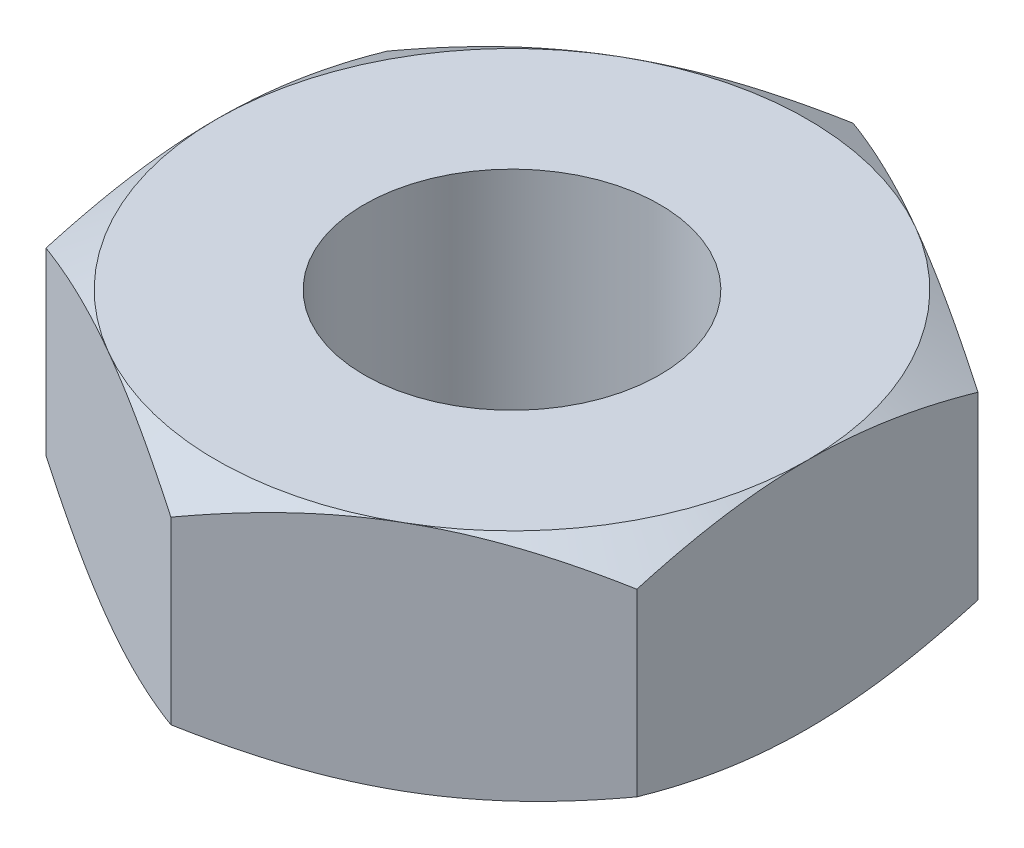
from build123d import *

# Parameters (mm, degrees)
BOSS_EXTRUDE1_DEPTH     = 5
SKETCH2_R               = 6.35
CUT_EXTRUDE1_DEPTH      = 22.82529114
SKETCH3_OUTSIDE_W       = 114.482
SKETCH3_OUTSIDE_H       = 118.412
SKETCH3_OUTSIDE_R       = 12.7
CUT_EXTRUDE2_DEPTH      = 22.82529114
CUT_EXTRUDE2_DRAFT      = -60
MIRROR1_COPY_1_SKETCH_W = 114.482
MIRROR1_COPY_1_SKETCH_H = 118.412
MIRROR1_COPY_1_SKETCH_R = 12.7
MIRROR1_COPY_1_DEPTH    = 22.82529114
MIRROR1_COPY_1_DRAFT    = -60


with BuildPart() as part:
    # Sketch1 → Boss-Extrude1 (new, symmetric)
    with BuildSketch(Plane(origin=(0, 0, 0), x_dir=(1, 0, 0), z_dir=(0, 1, 0))):
        Polygon((12.7, 7.332348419), (0, 14.664696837), (-12.7, 7.332348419), (-12.7, -7.332348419), (0, -14.664696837), (12.7, -7.332348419), align=None)
    extrude(amount=BOSS_EXTRUDE1_DEPTH, both=True)

    # Sketch2 → Cut-Extrude1 (cut, through all)
    with BuildSketch(Plane(origin=(0, 5, 0), x_dir=(1, 0, 0), z_dir=(0, 1, 0))):
        with Locations(Location((0, 0, 0), (0, 0, 270))):
            Circle(SKETCH2_R)
    extrude(amount=-CUT_EXTRUDE1_DEPTH, mode=Mode.SUBTRACT)


with BuildPart() as cut_extrude2_tool:
    # Sketch3 outside → Cut-Extrude2 (with draft: the straight prism first)
    with BuildSketch(Plane(origin=(0, 5, 0), x_dir=(1, 0, 0), z_dir=(0, 1, 0))):
        Rectangle(SKETCH3_OUTSIDE_W, SKETCH3_OUTSIDE_H)
        Circle(SKETCH3_OUTSIDE_R, mode=Mode.SUBTRACT)
    extrude(amount=-CUT_EXTRUDE2_DEPTH)
    # Cut-Extrude2: the draft: its side faces are tilted about the plane it starts from
    cut_extrude2_sides = [cut_extrude2_tool.faces().sort_by_distance(p)[0] for p in [
        (0, -6.41264557, 59.206),
        (57.241, -6.41264557, 0),
        (0, -6.41264557, -59.206),
        (-57.241, -6.41264557, 0),
        (-12.7, -6.41264557, 0),
    ]]
    draft(cut_extrude2_sides, Plane(origin=(0, 5, 0), x_dir=(1, 0, 0), z_dir=(0, 1, 0)), CUT_EXTRUDE2_DRAFT)


with BuildPart() as part_1:
    add(part.part)

    # Cut-Extrude2: cut by cut_extrude2_tool
    add(cut_extrude2_tool.part, mode=Mode.SUBTRACT)


with BuildPart() as mirror1_copy_1_tool:
    # Mirror1 copy 1 sketch → Mirror1 copy 1 (with draft: the straight prism first)
    with BuildSketch(Plane.XZ.offset(5)):
        Rectangle(MIRROR1_COPY_1_SKETCH_W, MIRROR1_COPY_1_SKETCH_H)
        Circle(MIRROR1_COPY_1_SKETCH_R, mode=Mode.SUBTRACT)
    extrude(amount=-MIRROR1_COPY_1_DEPTH)
    # Mirror1 copy 1: the draft: its side faces are tilted about the plane it starts from
    mirror1_copy_1_sides = [mirror1_copy_1_tool.faces().sort_by_distance(p)[0] for p in [
        (0, 6.41264557, 59.206),
        (57.241, 6.41264557, 0),
        (0, 6.41264557, -59.206),
        (-57.241, 6.41264557, 0),
        (-12.7, 6.41264557, 0),
    ]]
    draft(mirror1_copy_1_sides, Plane.XZ.offset(5), MIRROR1_COPY_1_DRAFT)


with BuildPart() as part_2:
    add(part_1.part)

    # Mirror1 copy 1: cut by mirror1_copy_1_tool
    add(mirror1_copy_1_tool.part, mode=Mode.SUBTRACT)


solid = part_2.part
